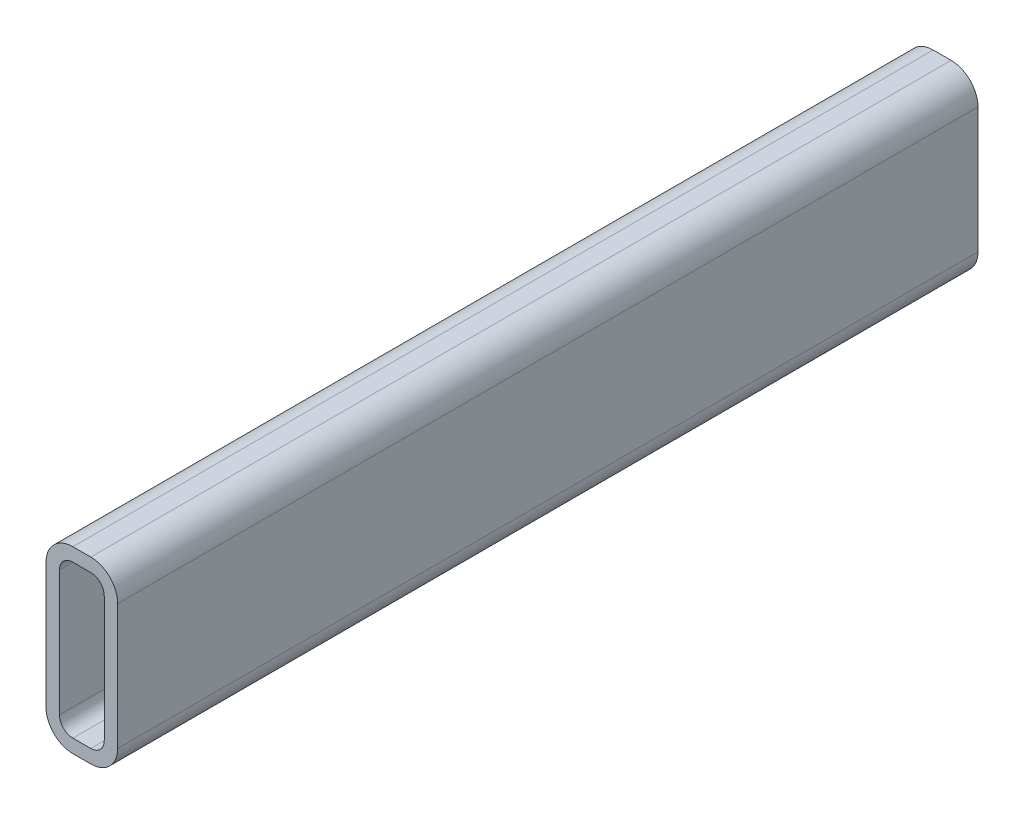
ISO-10303-21;
HEADER;
FILE_DESCRIPTION(('STEP AP214'),'2;1');
FILE_NAME('part.step','',(''),(''),'','','');
FILE_SCHEMA(('AUTOMOTIVE_DESIGN { 1 0 10303 214 1 1 1 1 }'));
ENDSEC;
DATA;
#1=APPLICATION_CONTEXT('core data for automotive mechanical design processes');
#2=APPLICATION_PROTOCOL_DEFINITION('international standard','automotive_design',2000,#1);
#3=PRODUCT_CONTEXT('',#1,'mechanical');
#4=PRODUCT('Part','Part','',(#3));
#5=PRODUCT_RELATED_PRODUCT_CATEGORY('part','',(#4));
#6=PRODUCT_DEFINITION_FORMATION('','',#4);
#7=PRODUCT_DEFINITION_CONTEXT('part definition',#1,'design');
#8=PRODUCT_DEFINITION('design','',#6,#7);
#9=PRODUCT_DEFINITION_SHAPE('','',#8);
#10=(LENGTH_UNIT() NAMED_UNIT(*) SI_UNIT(.MILLI.,.METRE.));
#11=(NAMED_UNIT(*) PLANE_ANGLE_UNIT() SI_UNIT($,.RADIAN.));
#12=(NAMED_UNIT(*) SI_UNIT($,.STERADIAN.) SOLID_ANGLE_UNIT());
#13=UNCERTAINTY_MEASURE_WITH_UNIT(LENGTH_MEASURE(1.E-05),#10,'distance_accuracy_value','');
#14=(GEOMETRIC_REPRESENTATION_CONTEXT(3) GLOBAL_UNCERTAINTY_ASSIGNED_CONTEXT((#13)) GLOBAL_UNIT_ASSIGNED_CONTEXT((#10,
#11,#12)) REPRESENTATION_CONTEXT('',''));
#15=CARTESIAN_POINT('',(0.,0.,0.));
#16=DIRECTION('',(0.,0.,1.));
#17=DIRECTION('',(1.,0.,0.));
#18=AXIS2_PLACEMENT_3D('',#15,#16,#17);
#19=CARTESIAN_POINT('',(9.525,53.975,304.8));
#20=DIRECTION('',(0.,0.,1.));
#21=DIRECTION('',(1.,0.,0.));
#22=AXIS2_PLACEMENT_3D('',#19,#20,#21);
#23=PLANE('',#22);
#24=CARTESIAN_POINT('',(9.525,53.975,304.8));
#25=DIRECTION('',(0.,0.,1.));
#26=DIRECTION('',(1.,0.,0.));
#27=AXIS2_PLACEMENT_3D('',#24,#25,#26);
#28=CIRCLE('',#27,9.525);
#29=CARTESIAN_POINT('',(9.525,63.5,304.8));
#30=VERTEX_POINT('',#29);
#31=CARTESIAN_POINT('',(0.,53.975,304.8));
#32=VERTEX_POINT('',#31);
#33=EDGE_CURVE('E211',#30,#32,#28,.T.);
#34=ORIENTED_EDGE('',*,*,#33,.T.);
#35=DIRECTION('',(0.,-1.,0.));
#36=VECTOR('',#35,1.);
#37=CARTESIAN_POINT('',(0.,9.525,304.8));
#38=LINE('',#37,#36);
#39=CARTESIAN_POINT('',(0.,9.525,304.8));
#40=VERTEX_POINT('',#39);
#41=EDGE_CURVE('E214',#32,#40,#38,.T.);
#42=ORIENTED_EDGE('',*,*,#41,.T.);
#43=CARTESIAN_POINT('',(9.525,9.525,304.8));
#44=DIRECTION('',(0.,0.,1.));
#45=DIRECTION('',(1.,0.,0.));
#46=AXIS2_PLACEMENT_3D('',#43,#44,#45);
#47=CIRCLE('',#46,9.525);
#48=CARTESIAN_POINT('',(9.525,0.,304.8));
#49=VERTEX_POINT('',#48);
#50=EDGE_CURVE('E217',#40,#49,#47,.T.);
#51=ORIENTED_EDGE('',*,*,#50,.T.);
#52=DIRECTION('',(1.,0.,0.));
#53=VECTOR('',#52,1.);
#54=CARTESIAN_POINT('',(15.875,0.,304.8));
#55=LINE('',#54,#53);
#56=CARTESIAN_POINT('',(15.875,0.,304.8));
#57=VERTEX_POINT('',#56);
#58=EDGE_CURVE('E219',#49,#57,#55,.T.);
#59=ORIENTED_EDGE('',*,*,#58,.T.);
#60=CARTESIAN_POINT('',(15.875,9.525,304.8));
#61=DIRECTION('',(0.,0.,1.));
#62=DIRECTION('',(1.,0.,0.));
#63=AXIS2_PLACEMENT_3D('',#60,#61,#62);
#64=CIRCLE('',#63,9.525);
#65=CARTESIAN_POINT('',(25.4,9.525,304.8));
#66=VERTEX_POINT('',#65);
#67=EDGE_CURVE('E221',#57,#66,#64,.T.);
#68=ORIENTED_EDGE('',*,*,#67,.T.);
#69=DIRECTION('',(0.,1.,0.));
#70=VECTOR('',#69,1.);
#71=CARTESIAN_POINT('',(25.4,53.975,304.8));
#72=LINE('',#71,#70);
#73=CARTESIAN_POINT('',(25.4,53.975,304.8));
#74=VERTEX_POINT('',#73);
#75=EDGE_CURVE('E223',#66,#74,#72,.T.);
#76=ORIENTED_EDGE('',*,*,#75,.T.);
#77=CARTESIAN_POINT('',(15.875,53.975,304.8));
#78=DIRECTION('',(0.,0.,1.));
#79=DIRECTION('',(1.,0.,0.));
#80=AXIS2_PLACEMENT_3D('',#77,#78,#79);
#81=CIRCLE('',#80,9.525);
#82=CARTESIAN_POINT('',(15.875,63.5,304.8));
#83=VERTEX_POINT('',#82);
#84=EDGE_CURVE('E225',#74,#83,#81,.T.);
#85=ORIENTED_EDGE('',*,*,#84,.T.);
#86=DIRECTION('',(-1.,0.,0.));
#87=VECTOR('',#86,1.);
#88=CARTESIAN_POINT('',(9.525,63.5,304.8));
#89=LINE('',#88,#87);
#90=EDGE_CURVE('E227',#83,#30,#89,.T.);
#91=ORIENTED_EDGE('',*,*,#90,.T.);
#92=EDGE_LOOP('',(#34,#42,#51,#59,#68,#76,#85,#91));
#93=FACE_BOUND('',#92,.T.);
#94=DIRECTION('',(0.,-1.,0.));
#95=VECTOR('',#94,1.);
#96=CARTESIAN_POINT('',(4.7625,9.525,304.8));
#97=LINE('',#96,#95);
#98=CARTESIAN_POINT('',(4.7625,53.975,304.8));
#99=VERTEX_POINT('',#98);
#100=CARTESIAN_POINT('',(4.7625,9.525,304.8));
#101=VERTEX_POINT('',#100);
#102=EDGE_CURVE('E154',#99,#101,#97,.T.);
#103=ORIENTED_EDGE('',*,*,#102,.F.);
#104=CARTESIAN_POINT('',(9.525,53.975,304.8));
#105=DIRECTION('',(0.,0.,1.));
#106=DIRECTION('',(1.,0.,0.));
#107=AXIS2_PLACEMENT_3D('',#104,#105,#106);
#108=CIRCLE('',#107,4.76249999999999);
#109=CARTESIAN_POINT('',(9.525,58.7375,304.8));
#110=VERTEX_POINT('',#109);
#111=EDGE_CURVE('E146',#110,#99,#108,.T.);
#112=ORIENTED_EDGE('',*,*,#111,.F.);
#113=DIRECTION('',(-1.,0.,0.));
#114=VECTOR('',#113,1.);
#115=CARTESIAN_POINT('',(9.525,58.7375,304.8));
#116=LINE('',#115,#114);
#117=CARTESIAN_POINT('',(15.875,58.7375,304.8));
#118=VERTEX_POINT('',#117);
#119=EDGE_CURVE('E179',#118,#110,#116,.T.);
#120=ORIENTED_EDGE('',*,*,#119,.F.);
#121=CARTESIAN_POINT('',(15.875,53.975,304.8));
#122=DIRECTION('',(0.,0.,1.));
#123=DIRECTION('',(1.,0.,0.));
#124=AXIS2_PLACEMENT_3D('',#121,#122,#123);
#125=CIRCLE('',#124,4.76249999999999);
#126=CARTESIAN_POINT('',(20.6375,53.975,304.8));
#127=VERTEX_POINT('',#126);
#128=EDGE_CURVE('E177',#127,#118,#125,.T.);
#129=ORIENTED_EDGE('',*,*,#128,.F.);
#130=DIRECTION('',(0.,1.,0.));
#131=VECTOR('',#130,1.);
#132=CARTESIAN_POINT('',(20.6375,53.975,304.8));
#133=LINE('',#132,#131);
#134=CARTESIAN_POINT('',(20.6375,9.525,304.8));
#135=VERTEX_POINT('',#134);
#136=EDGE_CURVE('E175',#135,#127,#133,.T.);
#137=ORIENTED_EDGE('',*,*,#136,.F.);
#138=CARTESIAN_POINT('',(15.875,9.525,304.8));
#139=DIRECTION('',(0.,0.,1.));
#140=DIRECTION('',(1.,0.,0.));
#141=AXIS2_PLACEMENT_3D('',#138,#139,#140);
#142=CIRCLE('',#141,4.7625);
#143=CARTESIAN_POINT('',(15.875,4.7625,304.8));
#144=VERTEX_POINT('',#143);
#145=EDGE_CURVE('E173',#144,#135,#142,.T.);
#146=ORIENTED_EDGE('',*,*,#145,.F.);
#147=DIRECTION('',(1.,0.,0.));
#148=VECTOR('',#147,1.);
#149=CARTESIAN_POINT('',(15.875,4.7625,304.8));
#150=LINE('',#149,#148);
#151=CARTESIAN_POINT('',(9.525,4.7625,304.8));
#152=VERTEX_POINT('',#151);
#153=EDGE_CURVE('E169',#152,#144,#150,.T.);
#154=ORIENTED_EDGE('',*,*,#153,.F.);
#155=CARTESIAN_POINT('',(9.525,9.525,304.8));
#156=DIRECTION('',(0.,0.,1.));
#157=DIRECTION('',(1.,0.,0.));
#158=AXIS2_PLACEMENT_3D('',#155,#156,#157);
#159=CIRCLE('',#158,4.7625);
#160=EDGE_CURVE('E167',#101,#152,#159,.T.);
#161=ORIENTED_EDGE('',*,*,#160,.F.);
#162=EDGE_LOOP('',(#103,#112,#120,#129,#137,#146,#154,#161));
#163=FACE_BOUND('',#162,.T.);
#164=ADVANCED_FACE('F33',(#93,#163),#23,.T.);
#165=CARTESIAN_POINT('',(9.525,53.975,0.));
#166=DIRECTION('',(0.,0.,1.));
#167=DIRECTION('',(1.,0.,0.));
#168=AXIS2_PLACEMENT_3D('',#165,#166,#167);
#169=PLANE('',#168);
#170=CARTESIAN_POINT('',(9.525,53.975,0.));
#171=DIRECTION('',(0.,0.,1.));
#172=DIRECTION('',(1.,0.,0.));
#173=AXIS2_PLACEMENT_3D('',#170,#171,#172);
#174=CIRCLE('',#173,9.525);
#175=CARTESIAN_POINT('',(9.525,63.5,0.));
#176=VERTEX_POINT('',#175);
#177=CARTESIAN_POINT('',(0.,53.975,0.));
#178=VERTEX_POINT('',#177);
#179=EDGE_CURVE('E162',#176,#178,#174,.T.);
#180=ORIENTED_EDGE('',*,*,#179,.F.);
#181=DIRECTION('',(-1.,0.,0.));
#182=VECTOR('',#181,1.);
#183=CARTESIAN_POINT('',(9.525,63.5,0.));
#184=LINE('',#183,#182);
#185=CARTESIAN_POINT('',(15.875,63.5,0.));
#186=VERTEX_POINT('',#185);
#187=EDGE_CURVE('E215',#186,#176,#184,.T.);
#188=ORIENTED_EDGE('',*,*,#187,.F.);
#189=CARTESIAN_POINT('',(15.875,53.975,0.));
#190=DIRECTION('',(0.,0.,1.));
#191=DIRECTION('',(1.,0.,0.));
#192=AXIS2_PLACEMENT_3D('',#189,#190,#191);
#193=CIRCLE('',#192,9.525);
#194=CARTESIAN_POINT('',(25.4,53.975,0.));
#195=VERTEX_POINT('',#194);
#196=EDGE_CURVE('E242',#195,#186,#193,.T.);
#197=ORIENTED_EDGE('',*,*,#196,.F.);
#198=DIRECTION('',(0.,1.,0.));
#199=VECTOR('',#198,1.);
#200=CARTESIAN_POINT('',(25.4,53.975,0.));
#201=LINE('',#200,#199);
#202=CARTESIAN_POINT('',(25.4,9.525,0.));
#203=VERTEX_POINT('',#202);
#204=EDGE_CURVE('E240',#203,#195,#201,.T.);
#205=ORIENTED_EDGE('',*,*,#204,.F.);
#206=CARTESIAN_POINT('',(15.875,9.525,0.));
#207=DIRECTION('',(0.,0.,1.));
#208=DIRECTION('',(1.,0.,0.));
#209=AXIS2_PLACEMENT_3D('',#206,#207,#208);
#210=CIRCLE('',#209,9.525);
#211=CARTESIAN_POINT('',(15.875,0.,0.));
#212=VERTEX_POINT('',#211);
#213=EDGE_CURVE('E238',#212,#203,#210,.T.);
#214=ORIENTED_EDGE('',*,*,#213,.F.);
#215=DIRECTION('',(1.,0.,0.));
#216=VECTOR('',#215,1.);
#217=CARTESIAN_POINT('',(15.875,0.,0.));
#218=LINE('',#217,#216);
#219=CARTESIAN_POINT('',(9.525,0.,0.));
#220=VERTEX_POINT('',#219);
#221=EDGE_CURVE('E236',#220,#212,#218,.T.);
#222=ORIENTED_EDGE('',*,*,#221,.F.);
#223=CARTESIAN_POINT('',(9.525,9.525,0.));
#224=DIRECTION('',(0.,0.,1.));
#225=DIRECTION('',(1.,0.,0.));
#226=AXIS2_PLACEMENT_3D('',#223,#224,#225);
#227=CIRCLE('',#226,9.525);
#228=CARTESIAN_POINT('',(0.,9.525,0.));
#229=VERTEX_POINT('',#228);
#230=EDGE_CURVE('E234',#229,#220,#227,.T.);
#231=ORIENTED_EDGE('',*,*,#230,.F.);
#232=DIRECTION('',(0.,-1.,0.));
#233=VECTOR('',#232,1.);
#234=CARTESIAN_POINT('',(0.,9.525,0.));
#235=LINE('',#234,#233);
#236=EDGE_CURVE('E232',#178,#229,#235,.T.);
#237=ORIENTED_EDGE('',*,*,#236,.F.);
#238=EDGE_LOOP('',(#180,#188,#197,#205,#214,#222,#231,#237));
#239=FACE_BOUND('',#238,.T.);
#240=CARTESIAN_POINT('',(9.525,53.975,0.));
#241=DIRECTION('',(0.,0.,1.));
#242=DIRECTION('',(1.,0.,0.));
#243=AXIS2_PLACEMENT_3D('',#240,#241,#242);
#244=CIRCLE('',#243,4.76249999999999);
#245=CARTESIAN_POINT('',(9.525,58.7375,0.));
#246=VERTEX_POINT('',#245);
#247=CARTESIAN_POINT('',(4.7625,53.975,0.));
#248=VERTEX_POINT('',#247);
#249=EDGE_CURVE('E56',#246,#248,#244,.T.);
#250=ORIENTED_EDGE('',*,*,#249,.T.);
#251=DIRECTION('',(0.,-1.,0.));
#252=VECTOR('',#251,1.);
#253=CARTESIAN_POINT('',(4.7625,9.525,0.));
#254=LINE('',#253,#252);
#255=CARTESIAN_POINT('',(4.7625,9.525,0.));
#256=VERTEX_POINT('',#255);
#257=EDGE_CURVE('E161',#248,#256,#254,.T.);
#258=ORIENTED_EDGE('',*,*,#257,.T.);
#259=CARTESIAN_POINT('',(9.525,9.525,0.));
#260=DIRECTION('',(0.,0.,1.));
#261=DIRECTION('',(1.,0.,0.));
#262=AXIS2_PLACEMENT_3D('',#259,#260,#261);
#263=CIRCLE('',#262,4.7625);
#264=CARTESIAN_POINT('',(9.525,4.7625,0.));
#265=VERTEX_POINT('',#264);
#266=EDGE_CURVE('E183',#256,#265,#263,.T.);
#267=ORIENTED_EDGE('',*,*,#266,.T.);
#268=DIRECTION('',(1.,0.,0.));
#269=VECTOR('',#268,1.);
#270=CARTESIAN_POINT('',(15.875,4.7625,0.));
#271=LINE('',#270,#269);
#272=CARTESIAN_POINT('',(15.875,4.7625,0.));
#273=VERTEX_POINT('',#272);
#274=EDGE_CURVE('E186',#265,#273,#271,.T.);
#275=ORIENTED_EDGE('',*,*,#274,.T.);
#276=CARTESIAN_POINT('',(15.875,9.525,0.));
#277=DIRECTION('',(0.,0.,1.));
#278=DIRECTION('',(1.,0.,0.));
#279=AXIS2_PLACEMENT_3D('',#276,#277,#278);
#280=CIRCLE('',#279,4.7625);
#281=CARTESIAN_POINT('',(20.6375,9.525,0.));
#282=VERTEX_POINT('',#281);
#283=EDGE_CURVE('E189',#273,#282,#280,.T.);
#284=ORIENTED_EDGE('',*,*,#283,.T.);
#285=DIRECTION('',(0.,1.,0.));
#286=VECTOR('',#285,1.);
#287=CARTESIAN_POINT('',(20.6375,53.975,0.));
#288=LINE('',#287,#286);
#289=CARTESIAN_POINT('',(20.6375,53.975,0.));
#290=VERTEX_POINT('',#289);
#291=EDGE_CURVE('E192',#282,#290,#288,.T.);
#292=ORIENTED_EDGE('',*,*,#291,.T.);
#293=CARTESIAN_POINT('',(15.875,53.975,0.));
#294=DIRECTION('',(0.,0.,1.));
#295=DIRECTION('',(1.,0.,0.));
#296=AXIS2_PLACEMENT_3D('',#293,#294,#295);
#297=CIRCLE('',#296,4.76249999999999);
#298=CARTESIAN_POINT('',(15.875,58.7375,0.));
#299=VERTEX_POINT('',#298);
#300=EDGE_CURVE('E195',#290,#299,#297,.T.);
#301=ORIENTED_EDGE('',*,*,#300,.T.);
#302=DIRECTION('',(-1.,0.,0.));
#303=VECTOR('',#302,1.);
#304=CARTESIAN_POINT('',(9.525,58.7375,0.));
#305=LINE('',#304,#303);
#306=EDGE_CURVE('E155',#299,#246,#305,.T.);
#307=ORIENTED_EDGE('',*,*,#306,.T.);
#308=EDGE_LOOP('',(#250,#258,#267,#275,#284,#292,#301,#307));
#309=FACE_BOUND('',#308,.T.);
#310=ADVANCED_FACE('F272',(#239,#309),#169,.F.);
#311=CARTESIAN_POINT('',(9.525,53.975,304.8));
#312=DIRECTION('',(0.,0.,-1.));
#313=DIRECTION('',(-1.,0.,0.));
#314=AXIS2_PLACEMENT_3D('',#311,#312,#313);
#315=CYLINDRICAL_SURFACE('',#314,9.525);
#316=ORIENTED_EDGE('',*,*,#179,.T.);
#317=DIRECTION('',(0.,0.,-1.));
#318=VECTOR('',#317,1.);
#319=CARTESIAN_POINT('',(0.,53.975,304.8));
#320=LINE('',#319,#318);
#321=EDGE_CURVE('E11',#32,#178,#320,.T.);
#322=ORIENTED_EDGE('',*,*,#321,.F.);
#323=ORIENTED_EDGE('',*,*,#33,.F.);
#324=DIRECTION('',(0.,0.,-1.));
#325=VECTOR('',#324,1.);
#326=CARTESIAN_POINT('',(9.525,63.5,304.8));
#327=LINE('',#326,#325);
#328=EDGE_CURVE('E229',#30,#176,#327,.T.);
#329=ORIENTED_EDGE('',*,*,#328,.T.);
#330=EDGE_LOOP('',(#316,#322,#323,#329));
#331=FACE_BOUND('',#330,.T.);
#332=ADVANCED_FACE('F35',(#331),#315,.T.);
#333=CARTESIAN_POINT('',(0.,9.525,304.8));
#334=DIRECTION('',(1.,0.,0.));
#335=DIRECTION('',(0.,0.,-1.));
#336=AXIS2_PLACEMENT_3D('',#333,#334,#335);
#337=PLANE('',#336);
#338=ORIENTED_EDGE('',*,*,#236,.T.);
#339=DIRECTION('',(0.,0.,-1.));
#340=VECTOR('',#339,1.);
#341=CARTESIAN_POINT('',(0.,9.525,304.8));
#342=LINE('',#341,#340);
#343=EDGE_CURVE('E41',#40,#229,#342,.T.);
#344=ORIENTED_EDGE('',*,*,#343,.F.);
#345=ORIENTED_EDGE('',*,*,#41,.F.);
#346=ORIENTED_EDGE('',*,*,#321,.T.);
#347=EDGE_LOOP('',(#338,#344,#345,#346));
#348=FACE_BOUND('',#347,.T.);
#349=ADVANCED_FACE('F289',(#348),#337,.F.);
#350=CARTESIAN_POINT('',(9.525,9.525,304.8));
#351=DIRECTION('',(0.,0.,-1.));
#352=DIRECTION('',(-1.,0.,0.));
#353=AXIS2_PLACEMENT_3D('',#350,#351,#352);
#354=CYLINDRICAL_SURFACE('',#353,9.525);
#355=ORIENTED_EDGE('',*,*,#230,.T.);
#356=DIRECTION('',(0.,0.,-1.));
#357=VECTOR('',#356,1.);
#358=CARTESIAN_POINT('',(9.525,0.,304.8));
#359=LINE('',#358,#357);
#360=EDGE_CURVE('E259',#49,#220,#359,.T.);
#361=ORIENTED_EDGE('',*,*,#360,.F.);
#362=ORIENTED_EDGE('',*,*,#50,.F.);
#363=ORIENTED_EDGE('',*,*,#343,.T.);
#364=EDGE_LOOP('',(#355,#361,#362,#363));
#365=FACE_BOUND('',#364,.T.);
#366=ADVANCED_FACE('F266',(#365),#354,.T.);
#367=CARTESIAN_POINT('',(15.875,0.,304.8));
#368=DIRECTION('',(0.,1.,0.));
#369=DIRECTION('',(0.,0.,1.));
#370=AXIS2_PLACEMENT_3D('',#367,#368,#369);
#371=PLANE('',#370);
#372=ORIENTED_EDGE('',*,*,#221,.T.);
#373=DIRECTION('',(0.,0.,-1.));
#374=VECTOR('',#373,1.);
#375=CARTESIAN_POINT('',(15.875,0.,304.8));
#376=LINE('',#375,#374);
#377=EDGE_CURVE('E256',#57,#212,#376,.T.);
#378=ORIENTED_EDGE('',*,*,#377,.F.);
#379=ORIENTED_EDGE('',*,*,#58,.F.);
#380=ORIENTED_EDGE('',*,*,#360,.T.);
#381=EDGE_LOOP('',(#372,#378,#379,#380));
#382=FACE_BOUND('',#381,.T.);
#383=ADVANCED_FACE('F278',(#382),#371,.F.);
#384=CARTESIAN_POINT('',(15.875,9.525,304.8));
#385=DIRECTION('',(0.,0.,-1.));
#386=DIRECTION('',(-1.,0.,0.));
#387=AXIS2_PLACEMENT_3D('',#384,#385,#386);
#388=CYLINDRICAL_SURFACE('',#387,9.525);
#389=ORIENTED_EDGE('',*,*,#213,.T.);
#390=DIRECTION('',(0.,0.,-1.));
#391=VECTOR('',#390,1.);
#392=CARTESIAN_POINT('',(25.4,9.525,304.8));
#393=LINE('',#392,#391);
#394=EDGE_CURVE('E253',#66,#203,#393,.T.);
#395=ORIENTED_EDGE('',*,*,#394,.F.);
#396=ORIENTED_EDGE('',*,*,#67,.F.);
#397=ORIENTED_EDGE('',*,*,#377,.T.);
#398=EDGE_LOOP('',(#389,#395,#396,#397));
#399=FACE_BOUND('',#398,.T.);
#400=ADVANCED_FACE('F282',(#399),#388,.T.);
#401=CARTESIAN_POINT('',(25.4,53.975,304.8));
#402=DIRECTION('',(-1.,0.,0.));
#403=DIRECTION('',(0.,0.,1.));
#404=AXIS2_PLACEMENT_3D('',#401,#402,#403);
#405=PLANE('',#404);
#406=ORIENTED_EDGE('',*,*,#204,.T.);
#407=DIRECTION('',(0.,0.,-1.));
#408=VECTOR('',#407,1.);
#409=CARTESIAN_POINT('',(25.4,53.975,304.8));
#410=LINE('',#409,#408);
#411=EDGE_CURVE('E250',#74,#195,#410,.T.);
#412=ORIENTED_EDGE('',*,*,#411,.F.);
#413=ORIENTED_EDGE('',*,*,#75,.F.);
#414=ORIENTED_EDGE('',*,*,#394,.T.);
#415=EDGE_LOOP('',(#406,#412,#413,#414));
#416=FACE_BOUND('',#415,.T.);
#417=ADVANCED_FACE('F302',(#416),#405,.F.);
#418=CARTESIAN_POINT('',(15.875,53.975,304.8));
#419=DIRECTION('',(0.,0.,-1.));
#420=DIRECTION('',(-1.,0.,0.));
#421=AXIS2_PLACEMENT_3D('',#418,#419,#420);
#422=CYLINDRICAL_SURFACE('',#421,9.525);
#423=ORIENTED_EDGE('',*,*,#196,.T.);
#424=DIRECTION('',(0.,0.,-1.));
#425=VECTOR('',#424,1.);
#426=CARTESIAN_POINT('',(15.875,63.5,304.8));
#427=LINE('',#426,#425);
#428=EDGE_CURVE('E247',#83,#186,#427,.T.);
#429=ORIENTED_EDGE('',*,*,#428,.F.);
#430=ORIENTED_EDGE('',*,*,#84,.F.);
#431=ORIENTED_EDGE('',*,*,#411,.T.);
#432=EDGE_LOOP('',(#423,#429,#430,#431));
#433=FACE_BOUND('',#432,.T.);
#434=ADVANCED_FACE('F300',(#433),#422,.T.);
#435=CARTESIAN_POINT('',(9.525,63.5,304.8));
#436=DIRECTION('',(0.,-1.,0.));
#437=DIRECTION('',(0.,0.,-1.));
#438=AXIS2_PLACEMENT_3D('',#435,#436,#437);
#439=PLANE('',#438);
#440=ORIENTED_EDGE('',*,*,#187,.T.);
#441=ORIENTED_EDGE('',*,*,#328,.F.);
#442=ORIENTED_EDGE('',*,*,#90,.F.);
#443=ORIENTED_EDGE('',*,*,#428,.T.);
#444=EDGE_LOOP('',(#440,#441,#442,#443));
#445=FACE_BOUND('',#444,.T.);
#446=ADVANCED_FACE('F295',(#445),#439,.F.);
#447=CARTESIAN_POINT('',(9.525,53.975,304.8));
#448=DIRECTION('',(0.,0.,-1.));
#449=DIRECTION('',(-1.,0.,0.));
#450=AXIS2_PLACEMENT_3D('',#447,#448,#449);
#451=CYLINDRICAL_SURFACE('',#450,4.76249999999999);
#452=ORIENTED_EDGE('',*,*,#249,.F.);
#453=DIRECTION('',(0.,0.,-1.));
#454=VECTOR('',#453,1.);
#455=CARTESIAN_POINT('',(9.525,58.7375,304.8));
#456=LINE('',#455,#454);
#457=EDGE_CURVE('E150',#110,#246,#456,.T.);
#458=ORIENTED_EDGE('',*,*,#457,.F.);
#459=ORIENTED_EDGE('',*,*,#111,.T.);
#460=DIRECTION('',(0.,0.,-1.));
#461=VECTOR('',#460,1.);
#462=CARTESIAN_POINT('',(4.7625,53.975,304.8));
#463=LINE('',#462,#461);
#464=EDGE_CURVE('E149',#99,#248,#463,.T.);
#465=ORIENTED_EDGE('',*,*,#464,.T.);
#466=EDGE_LOOP('',(#452,#458,#459,#465));
#467=FACE_BOUND('',#466,.T.);
#468=ADVANCED_FACE('F148',(#467),#451,.F.);
#469=CARTESIAN_POINT('',(4.7625,9.525,304.8));
#470=DIRECTION('',(1.,0.,0.));
#471=DIRECTION('',(0.,0.,-1.));
#472=AXIS2_PLACEMENT_3D('',#469,#470,#471);
#473=PLANE('',#472);
#474=ORIENTED_EDGE('',*,*,#257,.F.);
#475=ORIENTED_EDGE('',*,*,#464,.F.);
#476=ORIENTED_EDGE('',*,*,#102,.T.);
#477=DIRECTION('',(0.,0.,-1.));
#478=VECTOR('',#477,1.);
#479=CARTESIAN_POINT('',(4.7625,9.525,304.8));
#480=LINE('',#479,#478);
#481=EDGE_CURVE('E163',#101,#256,#480,.T.);
#482=ORIENTED_EDGE('',*,*,#481,.T.);
#483=EDGE_LOOP('',(#474,#475,#476,#482));
#484=FACE_BOUND('',#483,.T.);
#485=ADVANCED_FACE('F158',(#484),#473,.T.);
#486=CARTESIAN_POINT('',(9.525,9.525,304.8));
#487=DIRECTION('',(0.,0.,-1.));
#488=DIRECTION('',(-1.,0.,0.));
#489=AXIS2_PLACEMENT_3D('',#486,#487,#488);
#490=CYLINDRICAL_SURFACE('',#489,4.7625);
#491=ORIENTED_EDGE('',*,*,#266,.F.);
#492=ORIENTED_EDGE('',*,*,#481,.F.);
#493=ORIENTED_EDGE('',*,*,#160,.T.);
#494=DIRECTION('',(0.,0.,-1.));
#495=VECTOR('',#494,1.);
#496=CARTESIAN_POINT('',(9.525,4.7625,304.8));
#497=LINE('',#496,#495);
#498=EDGE_CURVE('E208',#152,#265,#497,.T.);
#499=ORIENTED_EDGE('',*,*,#498,.T.);
#500=EDGE_LOOP('',(#491,#492,#493,#499));
#501=FACE_BOUND('',#500,.T.);
#502=ADVANCED_FACE('F327',(#501),#490,.F.);
#503=CARTESIAN_POINT('',(15.875,4.7625,304.8));
#504=DIRECTION('',(0.,1.,0.));
#505=DIRECTION('',(0.,0.,1.));
#506=AXIS2_PLACEMENT_3D('',#503,#504,#505);
#507=PLANE('',#506);
#508=ORIENTED_EDGE('',*,*,#274,.F.);
#509=ORIENTED_EDGE('',*,*,#498,.F.);
#510=ORIENTED_EDGE('',*,*,#153,.T.);
#511=DIRECTION('',(0.,0.,-1.));
#512=VECTOR('',#511,1.);
#513=CARTESIAN_POINT('',(15.875,4.7625,304.8));
#514=LINE('',#513,#512);
#515=EDGE_CURVE('E206',#144,#273,#514,.T.);
#516=ORIENTED_EDGE('',*,*,#515,.T.);
#517=EDGE_LOOP('',(#508,#509,#510,#516));
#518=FACE_BOUND('',#517,.T.);
#519=ADVANCED_FACE('F331',(#518),#507,.T.);
#520=CARTESIAN_POINT('',(15.875,9.525,304.8));
#521=DIRECTION('',(0.,0.,-1.));
#522=DIRECTION('',(-1.,0.,0.));
#523=AXIS2_PLACEMENT_3D('',#520,#521,#522);
#524=CYLINDRICAL_SURFACE('',#523,4.7625);
#525=ORIENTED_EDGE('',*,*,#283,.F.);
#526=ORIENTED_EDGE('',*,*,#515,.F.);
#527=ORIENTED_EDGE('',*,*,#145,.T.);
#528=DIRECTION('',(0.,0.,-1.));
#529=VECTOR('',#528,1.);
#530=CARTESIAN_POINT('',(20.6375,9.525,304.8));
#531=LINE('',#530,#529);
#532=EDGE_CURVE('E204',#135,#282,#531,.T.);
#533=ORIENTED_EDGE('',*,*,#532,.T.);
#534=EDGE_LOOP('',(#525,#526,#527,#533));
#535=FACE_BOUND('',#534,.T.);
#536=ADVANCED_FACE('F337',(#535),#524,.F.);
#537=CARTESIAN_POINT('',(20.6375,53.975,304.8));
#538=DIRECTION('',(-1.,0.,0.));
#539=DIRECTION('',(0.,0.,1.));
#540=AXIS2_PLACEMENT_3D('',#537,#538,#539);
#541=PLANE('',#540);
#542=ORIENTED_EDGE('',*,*,#291,.F.);
#543=ORIENTED_EDGE('',*,*,#532,.F.);
#544=ORIENTED_EDGE('',*,*,#136,.T.);
#545=DIRECTION('',(0.,0.,-1.));
#546=VECTOR('',#545,1.);
#547=CARTESIAN_POINT('',(20.6375,53.975,304.8));
#548=LINE('',#547,#546);
#549=EDGE_CURVE('E202',#127,#290,#548,.T.);
#550=ORIENTED_EDGE('',*,*,#549,.T.);
#551=EDGE_LOOP('',(#542,#543,#544,#550));
#552=FACE_BOUND('',#551,.T.);
#553=ADVANCED_FACE('F341',(#552),#541,.T.);
#554=CARTESIAN_POINT('',(15.875,53.975,304.8));
#555=DIRECTION('',(0.,0.,-1.));
#556=DIRECTION('',(-1.,0.,0.));
#557=AXIS2_PLACEMENT_3D('',#554,#555,#556);
#558=CYLINDRICAL_SURFACE('',#557,4.76249999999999);
#559=ORIENTED_EDGE('',*,*,#300,.F.);
#560=ORIENTED_EDGE('',*,*,#549,.F.);
#561=ORIENTED_EDGE('',*,*,#128,.T.);
#562=DIRECTION('',(0.,0.,-1.));
#563=VECTOR('',#562,1.);
#564=CARTESIAN_POINT('',(15.875,58.7375,304.8));
#565=LINE('',#564,#563);
#566=EDGE_CURVE('E48',#118,#299,#565,.T.);
#567=ORIENTED_EDGE('',*,*,#566,.T.);
#568=EDGE_LOOP('',(#559,#560,#561,#567));
#569=FACE_BOUND('',#568,.T.);
#570=ADVANCED_FACE('F345',(#569),#558,.F.);
#571=CARTESIAN_POINT('',(9.525,58.7375,304.8));
#572=DIRECTION('',(0.,-1.,0.));
#573=DIRECTION('',(0.,0.,-1.));
#574=AXIS2_PLACEMENT_3D('',#571,#572,#573);
#575=PLANE('',#574);
#576=ORIENTED_EDGE('',*,*,#306,.F.);
#577=ORIENTED_EDGE('',*,*,#566,.F.);
#578=ORIENTED_EDGE('',*,*,#119,.T.);
#579=ORIENTED_EDGE('',*,*,#457,.T.);
#580=EDGE_LOOP('',(#576,#577,#578,#579));
#581=FACE_BOUND('',#580,.T.);
#582=ADVANCED_FACE('F349',(#581),#575,.T.);
#583=CLOSED_SHELL('',(#164,#310,#332,#349,#366,#383,#400,#417,#434,#446,#468,#485,#502,#519,
#536,#553,#570,#582));
#584=MANIFOLD_SOLID_BREP('B2',#583);
#585=ADVANCED_BREP_SHAPE_REPRESENTATION('',(#18,#584),#14);
#586=SHAPE_DEFINITION_REPRESENTATION(#9,#585);
ENDSEC;
END-ISO-10303-21;
